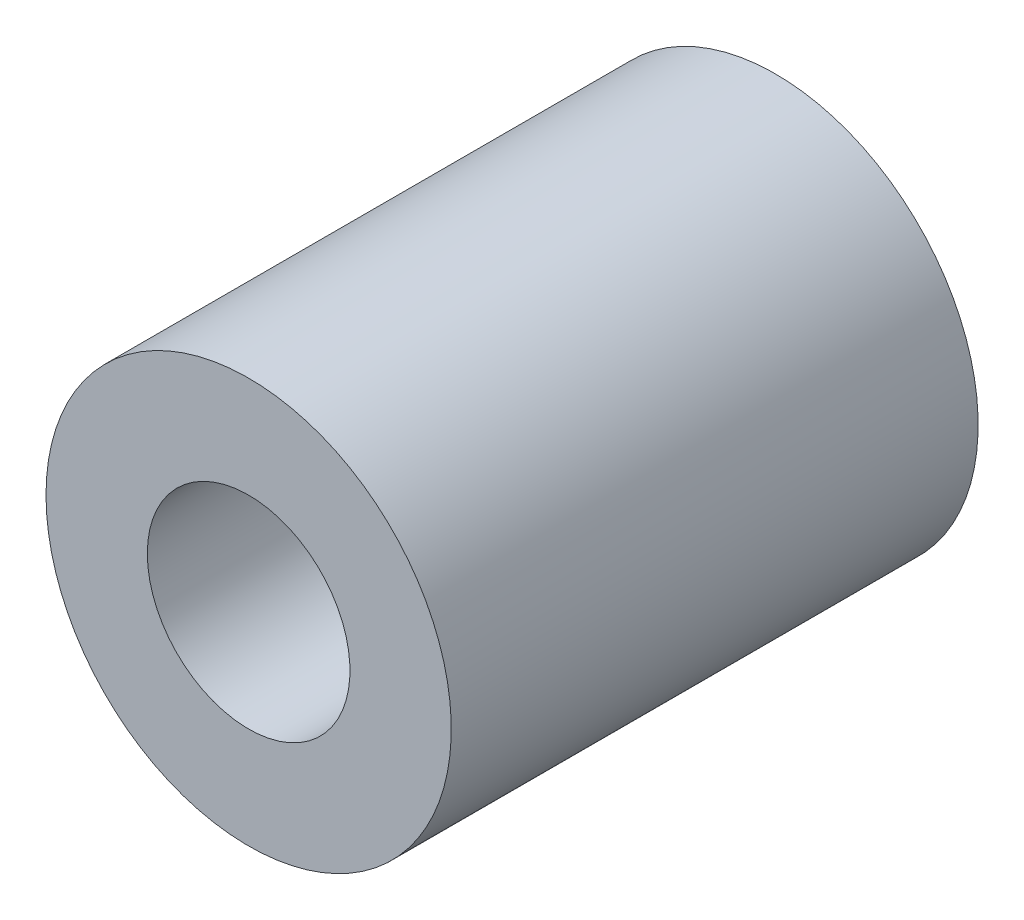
ISO-10303-21;
HEADER;
FILE_DESCRIPTION(('STEP AP214'),'2;1');
FILE_NAME('part.step','',(''),(''),'','','');
FILE_SCHEMA(('AUTOMOTIVE_DESIGN { 1 0 10303 214 1 1 1 1 }'));
ENDSEC;
DATA;
#1=APPLICATION_CONTEXT('core data for automotive mechanical design processes');
#2=APPLICATION_PROTOCOL_DEFINITION('international standard','automotive_design',2000,#1);
#3=PRODUCT_CONTEXT('',#1,'mechanical');
#4=PRODUCT('Part','Part','',(#3));
#5=PRODUCT_RELATED_PRODUCT_CATEGORY('part','',(#4));
#6=PRODUCT_DEFINITION_FORMATION('','',#4);
#7=PRODUCT_DEFINITION_CONTEXT('part definition',#1,'design');
#8=PRODUCT_DEFINITION('design','',#6,#7);
#9=PRODUCT_DEFINITION_SHAPE('','',#8);
#10=(LENGTH_UNIT() NAMED_UNIT(*) SI_UNIT(.MILLI.,.METRE.));
#11=(NAMED_UNIT(*) PLANE_ANGLE_UNIT() SI_UNIT($,.RADIAN.));
#12=(NAMED_UNIT(*) SI_UNIT($,.STERADIAN.) SOLID_ANGLE_UNIT());
#13=UNCERTAINTY_MEASURE_WITH_UNIT(LENGTH_MEASURE(1.E-05),#10,'distance_accuracy_value','');
#14=(GEOMETRIC_REPRESENTATION_CONTEXT(3) GLOBAL_UNCERTAINTY_ASSIGNED_CONTEXT((#13)) GLOBAL_UNIT_ASSIGNED_CONTEXT((#10,
#11,#12)) REPRESENTATION_CONTEXT('',''));
#15=CARTESIAN_POINT('',(0.,0.,0.));
#16=DIRECTION('',(0.,0.,1.));
#17=DIRECTION('',(1.,0.,0.));
#18=AXIS2_PLACEMENT_3D('',#15,#16,#17);
#19=CARTESIAN_POINT('',(0.,0.,26.));
#20=DIRECTION('',(0.,0.,0.999999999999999));
#21=DIRECTION('',(1.,0.,0.));
#22=AXIS2_PLACEMENT_3D('',#19,#20,#21);
#23=PLANE('',#22);
#24=CARTESIAN_POINT('',(0.,0.,26.));
#25=DIRECTION('',(0.,0.,0.999999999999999));
#26=DIRECTION('',(1.,0.,0.));
#27=AXIS2_PLACEMENT_3D('',#24,#25,#26);
#28=CIRCLE('',#27,9.99999999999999);
#29=CARTESIAN_POINT('',(-10.,0.,26.));
#30=VERTEX_POINT('',#29);
#31=EDGE_CURVE('E10',#30,#30,#28,.T.);
#32=ORIENTED_EDGE('',*,*,#31,.T.);
#33=EDGE_LOOP('',(#32));
#34=FACE_BOUND('',#33,.T.);
#35=CARTESIAN_POINT('',(0.,0.,26.));
#36=DIRECTION('',(0.,0.,0.999999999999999));
#37=DIRECTION('',(1.,0.,0.));
#38=AXIS2_PLACEMENT_3D('',#35,#36,#37);
#39=CIRCLE('',#38,5.);
#40=CARTESIAN_POINT('',(-5.00000000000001,0.,26.));
#41=VERTEX_POINT('',#40);
#42=EDGE_CURVE('E39',#41,#41,#39,.T.);
#43=ORIENTED_EDGE('',*,*,#42,.F.);
#44=EDGE_LOOP('',(#43));
#45=FACE_BOUND('',#44,.T.);
#46=ADVANCED_FACE('F28',(#34,#45),#23,.T.);
#47=CARTESIAN_POINT('',(0.,0.,0.));
#48=DIRECTION('',(0.,0.,0.999999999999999));
#49=DIRECTION('',(1.,0.,0.));
#50=AXIS2_PLACEMENT_3D('',#47,#48,#49);
#51=PLANE('',#50);
#52=CARTESIAN_POINT('',(0.,0.,0.));
#53=DIRECTION('',(0.,0.,0.999999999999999));
#54=DIRECTION('',(1.,0.,0.));
#55=AXIS2_PLACEMENT_3D('',#52,#53,#54);
#56=CIRCLE('',#55,9.99999999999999);
#57=CARTESIAN_POINT('',(-10.,0.,0.));
#58=VERTEX_POINT('',#57);
#59=EDGE_CURVE('E35',#58,#58,#56,.T.);
#60=ORIENTED_EDGE('',*,*,#59,.F.);
#61=EDGE_LOOP('',(#60));
#62=FACE_BOUND('',#61,.T.);
#63=CARTESIAN_POINT('',(0.,0.,0.));
#64=DIRECTION('',(0.,0.,0.999999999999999));
#65=DIRECTION('',(1.,0.,0.));
#66=AXIS2_PLACEMENT_3D('',#63,#64,#65);
#67=CIRCLE('',#66,5.);
#68=CARTESIAN_POINT('',(-5.00000000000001,0.,0.));
#69=VERTEX_POINT('',#68);
#70=EDGE_CURVE('E43',#69,#69,#67,.T.);
#71=ORIENTED_EDGE('',*,*,#70,.T.);
#72=EDGE_LOOP('',(#71));
#73=FACE_BOUND('',#72,.T.);
#74=ADVANCED_FACE('F49',(#62,#73),#51,.F.);
#75=CARTESIAN_POINT('',(0.,0.,26.));
#76=DIRECTION('',(0.,0.,-0.999999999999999));
#77=DIRECTION('',(-1.,0.,0.));
#78=AXIS2_PLACEMENT_3D('',#75,#76,#77);
#79=CYLINDRICAL_SURFACE('',#78,9.99999999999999);
#80=CARTESIAN_POINT('',(-10.,0.,26.));
#81=CARTESIAN_POINT('',(-10.,0.,25.7291666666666));
#82=CARTESIAN_POINT('',(-10.,0.,25.4583333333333));
#83=CARTESIAN_POINT('',(-10.,0.,24.9166666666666));
#84=CARTESIAN_POINT('',(-10.,0.,24.6458333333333));
#85=CARTESIAN_POINT('',(-10.,0.,24.1041666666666));
#86=CARTESIAN_POINT('',(-10.,0.,23.8333333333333));
#87=CARTESIAN_POINT('',(-10.,0.,23.2916666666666));
#88=CARTESIAN_POINT('',(-10.,0.,23.0208333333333));
#89=CARTESIAN_POINT('',(-10.,0.,22.4791666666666));
#90=CARTESIAN_POINT('',(-10.,0.,22.2083333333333));
#91=CARTESIAN_POINT('',(-10.,0.,21.6666666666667));
#92=CARTESIAN_POINT('',(-10.,0.,21.3958333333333));
#93=CARTESIAN_POINT('',(-10.,0.,20.8541666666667));
#94=CARTESIAN_POINT('',(-10.,0.,20.5833333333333));
#95=CARTESIAN_POINT('',(-10.,0.,20.0416666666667));
#96=CARTESIAN_POINT('',(-10.,0.,19.7708333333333));
#97=CARTESIAN_POINT('',(-10.,0.,19.2291666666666));
#98=CARTESIAN_POINT('',(-10.,0.,18.9583333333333));
#99=CARTESIAN_POINT('',(-10.,0.,18.4166666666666));
#100=CARTESIAN_POINT('',(-10.,0.,18.1458333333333));
#101=CARTESIAN_POINT('',(-10.,0.,17.6041666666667));
#102=CARTESIAN_POINT('',(-10.,0.,17.3333333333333));
#103=CARTESIAN_POINT('',(-10.,0.,16.7916666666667));
#104=CARTESIAN_POINT('',(-10.,0.,16.5208333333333));
#105=CARTESIAN_POINT('',(-10.,0.,15.9791666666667));
#106=CARTESIAN_POINT('',(-10.,0.,15.7083333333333));
#107=CARTESIAN_POINT('',(-10.,0.,15.1666666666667));
#108=CARTESIAN_POINT('',(-10.,0.,14.8958333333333));
#109=CARTESIAN_POINT('',(-10.,0.,14.3541666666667));
#110=CARTESIAN_POINT('',(-10.,0.,14.0833333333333));
#111=CARTESIAN_POINT('',(-10.,0.,13.5416666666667));
#112=CARTESIAN_POINT('',(-10.,0.,13.2708333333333));
#113=CARTESIAN_POINT('',(-10.,0.,12.7291666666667));
#114=CARTESIAN_POINT('',(-10.,0.,12.4583333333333));
#115=CARTESIAN_POINT('',(-10.,0.,11.9166666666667));
#116=CARTESIAN_POINT('',(-10.,0.,11.6458333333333));
#117=CARTESIAN_POINT('',(-10.,0.,11.1041666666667));
#118=CARTESIAN_POINT('',(-10.,0.,10.8333333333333));
#119=CARTESIAN_POINT('',(-10.,0.,10.2916666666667));
#120=CARTESIAN_POINT('',(-10.,0.,10.0208333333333));
#121=CARTESIAN_POINT('',(-10.,0.,9.47916666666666));
#122=CARTESIAN_POINT('',(-10.,0.,9.20833333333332));
#123=CARTESIAN_POINT('',(-10.,0.,8.66666666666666));
#124=CARTESIAN_POINT('',(-10.,0.,8.39583333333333));
#125=CARTESIAN_POINT('',(-10.,0.,7.85416666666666));
#126=CARTESIAN_POINT('',(-10.,0.,7.58333333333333));
#127=CARTESIAN_POINT('',(-10.,0.,7.04166666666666));
#128=CARTESIAN_POINT('',(-10.,0.,6.77083333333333));
#129=CARTESIAN_POINT('',(-10.,0.,6.22916666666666));
#130=CARTESIAN_POINT('',(-10.,0.,5.95833333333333));
#131=CARTESIAN_POINT('',(-10.,0.,5.41666666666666));
#132=CARTESIAN_POINT('',(-10.,0.,5.14583333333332));
#133=CARTESIAN_POINT('',(-10.,0.,4.60416666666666));
#134=CARTESIAN_POINT('',(-10.,0.,4.33333333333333));
#135=CARTESIAN_POINT('',(-10.,0.,3.79166666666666));
#136=CARTESIAN_POINT('',(-10.,0.,3.52083333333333));
#137=CARTESIAN_POINT('',(-10.,0.,2.97916666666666));
#138=CARTESIAN_POINT('',(-10.,0.,2.70833333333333));
#139=CARTESIAN_POINT('',(-10.,0.,2.16666666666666));
#140=CARTESIAN_POINT('',(-10.,0.,1.89583333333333));
#141=CARTESIAN_POINT('',(-10.,0.,1.35416666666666));
#142=CARTESIAN_POINT('',(-10.,0.,1.08333333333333));
#143=CARTESIAN_POINT('',(-10.,0.,0.541666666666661));
#144=CARTESIAN_POINT('',(-10.,0.,0.270833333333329));
#145=CARTESIAN_POINT('',(-10.,0.,0.));
#146=B_SPLINE_CURVE_WITH_KNOTS('',3,(#80,#81,#82,#83,#84,#85,#86,#87,#88,#89,#90,#91,#92,#93,
#94,#95,#96,#97,#98,#99,#100,#101,#102,#103,#104,#105,#106,#107,#108,#109,#110,#111,#112,#113,
#114,#115,#116,#117,#118,#119,#120,#121,#122,#123,#124,#125,#126,#127,#128,#129,#130,#131,#132,
#133,#134,#135,#136,#137,#138,#139,#140,#141,#142,#143,#144,#145),.UNSPECIFIED.,.F.,.F.,(4,2,2,
2,2,2,2,2,2,2,2,2,2,2,2,2,2,2,2,2,2,2,2,2,2,2,2,2,2,2,2,2,4),(0.,0.812500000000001,1.625,2.4375,
3.25,4.0625,4.875,5.6875,6.5,7.3125,8.125,8.93749999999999,9.74999999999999,10.5625,11.375,
12.1875,13.,13.8125,14.625,15.4375,16.25,17.0625,17.875,18.6875,19.5,20.3125,21.125,21.9375,
22.75,23.5625,24.375,25.1875,26.),.UNSPECIFIED.);
#147=EDGE_CURVE('BSEAM30',#30,#58,#146,.T.);
#148=ORIENTED_EDGE('',*,*,#31,.F.);
#149=ORIENTED_EDGE('',*,*,#59,.T.);
#150=ORIENTED_EDGE('',*,*,#147,.T.);
#151=ORIENTED_EDGE('',*,*,#147,.F.);
#152=EDGE_LOOP('',(#148,#150,#149,#151));
#153=FACE_BOUND('',#152,.T.);
#154=ADVANCED_FACE('F30',(#153),#79,.T.);
#155=CARTESIAN_POINT('',(0.,0.,26.));
#156=DIRECTION('',(0.,0.,-0.999999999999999));
#157=DIRECTION('',(-1.,0.,0.));
#158=AXIS2_PLACEMENT_3D('',#155,#156,#157);
#159=CYLINDRICAL_SURFACE('',#158,5.);
#160=CARTESIAN_POINT('',(-5.00000000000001,0.,26.));
#161=CARTESIAN_POINT('',(-5.00000000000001,0.,25.7291666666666));
#162=CARTESIAN_POINT('',(-5.00000000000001,0.,25.4583333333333));
#163=CARTESIAN_POINT('',(-5.00000000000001,0.,24.9166666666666));
#164=CARTESIAN_POINT('',(-5.00000000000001,0.,24.6458333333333));
#165=CARTESIAN_POINT('',(-5.00000000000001,0.,24.1041666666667));
#166=CARTESIAN_POINT('',(-5.00000000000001,0.,23.8333333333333));
#167=CARTESIAN_POINT('',(-5.00000000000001,0.,23.2916666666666));
#168=CARTESIAN_POINT('',(-5.00000000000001,0.,23.0208333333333));
#169=CARTESIAN_POINT('',(-5.00000000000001,0.,22.4791666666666));
#170=CARTESIAN_POINT('',(-5.00000000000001,0.,22.2083333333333));
#171=CARTESIAN_POINT('',(-5.00000000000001,0.,21.6666666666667));
#172=CARTESIAN_POINT('',(-5.00000000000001,0.,21.3958333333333));
#173=CARTESIAN_POINT('',(-5.00000000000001,0.,20.8541666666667));
#174=CARTESIAN_POINT('',(-5.00000000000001,0.,20.5833333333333));
#175=CARTESIAN_POINT('',(-5.00000000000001,0.,20.0416666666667));
#176=CARTESIAN_POINT('',(-5.00000000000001,0.,19.7708333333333));
#177=CARTESIAN_POINT('',(-5.00000000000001,0.,19.2291666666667));
#178=CARTESIAN_POINT('',(-5.00000000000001,0.,18.9583333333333));
#179=CARTESIAN_POINT('',(-5.00000000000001,0.,18.4166666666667));
#180=CARTESIAN_POINT('',(-5.00000000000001,0.,18.1458333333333));
#181=CARTESIAN_POINT('',(-5.00000000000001,0.,17.6041666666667));
#182=CARTESIAN_POINT('',(-5.00000000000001,0.,17.3333333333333));
#183=CARTESIAN_POINT('',(-5.00000000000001,0.,16.7916666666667));
#184=CARTESIAN_POINT('',(-5.00000000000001,0.,16.5208333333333));
#185=CARTESIAN_POINT('',(-5.00000000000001,0.,15.9791666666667));
#186=CARTESIAN_POINT('',(-5.00000000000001,0.,15.7083333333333));
#187=CARTESIAN_POINT('',(-5.00000000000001,0.,15.1666666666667));
#188=CARTESIAN_POINT('',(-5.00000000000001,0.,14.8958333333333));
#189=CARTESIAN_POINT('',(-5.00000000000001,0.,14.3541666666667));
#190=CARTESIAN_POINT('',(-5.00000000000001,0.,14.0833333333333));
#191=CARTESIAN_POINT('',(-5.00000000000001,0.,13.5416666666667));
#192=CARTESIAN_POINT('',(-5.00000000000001,0.,13.2708333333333));
#193=CARTESIAN_POINT('',(-5.00000000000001,0.,12.7291666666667));
#194=CARTESIAN_POINT('',(-5.00000000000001,0.,12.4583333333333));
#195=CARTESIAN_POINT('',(-5.00000000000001,0.,11.9166666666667));
#196=CARTESIAN_POINT('',(-5.00000000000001,0.,11.6458333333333));
#197=CARTESIAN_POINT('',(-5.00000000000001,0.,11.1041666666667));
#198=CARTESIAN_POINT('',(-5.00000000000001,0.,10.8333333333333));
#199=CARTESIAN_POINT('',(-5.00000000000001,0.,10.2916666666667));
#200=CARTESIAN_POINT('',(-5.00000000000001,0.,10.0208333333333));
#201=CARTESIAN_POINT('',(-5.00000000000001,0.,9.47916666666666));
#202=CARTESIAN_POINT('',(-5.00000000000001,0.,9.20833333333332));
#203=CARTESIAN_POINT('',(-5.00000000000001,0.,8.66666666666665));
#204=CARTESIAN_POINT('',(-5.00000000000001,0.,8.39583333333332));
#205=CARTESIAN_POINT('',(-5.00000000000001,0.,7.85416666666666));
#206=CARTESIAN_POINT('',(-5.00000000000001,0.,7.58333333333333));
#207=CARTESIAN_POINT('',(-5.00000000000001,0.,7.04166666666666));
#208=CARTESIAN_POINT('',(-5.00000000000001,0.,6.77083333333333));
#209=CARTESIAN_POINT('',(-5.00000000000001,0.,6.22916666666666));
#210=CARTESIAN_POINT('',(-5.00000000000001,0.,5.95833333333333));
#211=CARTESIAN_POINT('',(-5.00000000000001,0.,5.41666666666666));
#212=CARTESIAN_POINT('',(-5.00000000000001,0.,5.14583333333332));
#213=CARTESIAN_POINT('',(-5.00000000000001,0.,4.60416666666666));
#214=CARTESIAN_POINT('',(-5.00000000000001,0.,4.33333333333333));
#215=CARTESIAN_POINT('',(-5.00000000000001,0.,3.79166666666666));
#216=CARTESIAN_POINT('',(-5.00000000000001,0.,3.52083333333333));
#217=CARTESIAN_POINT('',(-5.00000000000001,0.,2.97916666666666));
#218=CARTESIAN_POINT('',(-5.00000000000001,0.,2.70833333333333));
#219=CARTESIAN_POINT('',(-5.00000000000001,0.,2.16666666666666));
#220=CARTESIAN_POINT('',(-5.00000000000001,0.,1.89583333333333));
#221=CARTESIAN_POINT('',(-5.00000000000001,0.,1.35416666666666));
#222=CARTESIAN_POINT('',(-5.00000000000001,0.,1.08333333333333));
#223=CARTESIAN_POINT('',(-5.00000000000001,0.,0.541666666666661));
#224=CARTESIAN_POINT('',(-5.00000000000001,0.,0.270833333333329));
#225=CARTESIAN_POINT('',(-5.00000000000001,0.,0.));
#226=B_SPLINE_CURVE_WITH_KNOTS('',3,(#160,#161,#162,#163,#164,#165,#166,#167,#168,#169,#170,
#171,#172,#173,#174,#175,#176,#177,#178,#179,#180,#181,#182,#183,#184,#185,#186,#187,#188,#189,
#190,#191,#192,#193,#194,#195,#196,#197,#198,#199,#200,#201,#202,#203,#204,#205,#206,#207,#208,
#209,#210,#211,#212,#213,#214,#215,#216,#217,#218,#219,#220,#221,#222,#223,#224,#225),
.UNSPECIFIED.,.F.,.F.,(4,2,2,2,2,2,2,2,2,2,2,2,2,2,2,2,2,2,2,2,2,2,2,2,2,2,2,2,2,2,2,2,4),(0.,
0.812499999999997,1.625,2.4375,3.25,4.0625,4.87499999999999,5.68749999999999,6.5,
7.31249999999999,8.12499999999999,8.93749999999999,9.74999999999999,10.5625,11.375,12.1875,13.,
13.8125,14.625,15.4375,16.25,17.0625,17.875,18.6875,19.5,20.3125,21.125,21.9375,22.75,23.5625,
24.375,25.1875,26.),.UNSPECIFIED.);
#227=EDGE_CURVE('BSEAM51',#41,#69,#226,.T.);
#228=ORIENTED_EDGE('',*,*,#42,.T.);
#229=ORIENTED_EDGE('',*,*,#70,.F.);
#230=ORIENTED_EDGE('',*,*,#227,.T.);
#231=ORIENTED_EDGE('',*,*,#227,.F.);
#232=EDGE_LOOP('',(#228,#230,#229,#231));
#233=FACE_BOUND('',#232,.T.);
#234=ADVANCED_FACE('F51',(#233),#159,.F.);
#235=CLOSED_SHELL('',(#46,#74,#154,#234));
#236=MANIFOLD_SOLID_BREP('B2',#235);
#237=ADVANCED_BREP_SHAPE_REPRESENTATION('',(#18,#236),#14);
#238=SHAPE_DEFINITION_REPRESENTATION(#9,#237);
ENDSEC;
END-ISO-10303-21;
